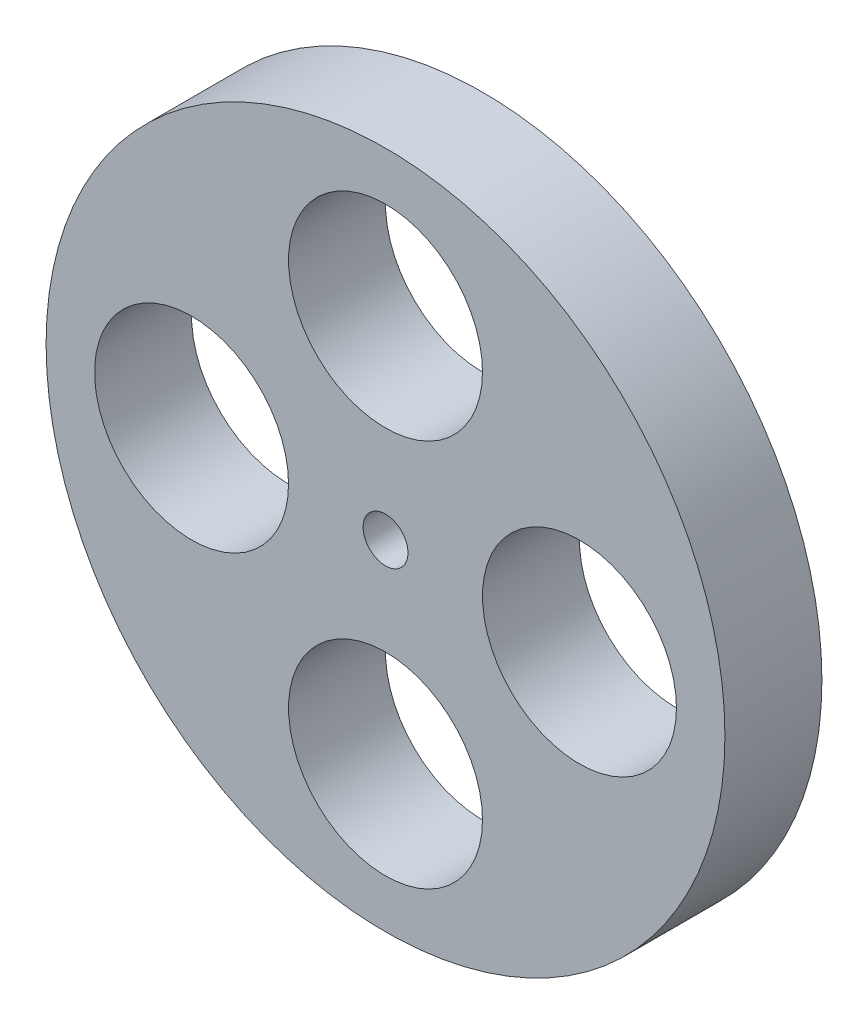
ISO-10303-21;
HEADER;
FILE_DESCRIPTION(('STEP AP214'),'2;1');
FILE_NAME('part.step','',(''),(''),'','','');
FILE_SCHEMA(('AUTOMOTIVE_DESIGN { 1 0 10303 214 1 1 1 1 }'));
ENDSEC;
DATA;
#1=APPLICATION_CONTEXT('core data for automotive mechanical design processes');
#2=APPLICATION_PROTOCOL_DEFINITION('international standard','automotive_design',2000,#1);
#3=PRODUCT_CONTEXT('',#1,'mechanical');
#4=PRODUCT('Part','Part','',(#3));
#5=PRODUCT_RELATED_PRODUCT_CATEGORY('part','',(#4));
#6=PRODUCT_DEFINITION_FORMATION('','',#4);
#7=PRODUCT_DEFINITION_CONTEXT('part definition',#1,'design');
#8=PRODUCT_DEFINITION('design','',#6,#7);
#9=PRODUCT_DEFINITION_SHAPE('','',#8);
#10=(LENGTH_UNIT() NAMED_UNIT(*) SI_UNIT(.MILLI.,.METRE.));
#11=(NAMED_UNIT(*) PLANE_ANGLE_UNIT() SI_UNIT($,.RADIAN.));
#12=(NAMED_UNIT(*) SI_UNIT($,.STERADIAN.) SOLID_ANGLE_UNIT());
#13=UNCERTAINTY_MEASURE_WITH_UNIT(LENGTH_MEASURE(1.E-05),#10,'distance_accuracy_value','');
#14=(GEOMETRIC_REPRESENTATION_CONTEXT(3) GLOBAL_UNCERTAINTY_ASSIGNED_CONTEXT((#13)) GLOBAL_UNIT_ASSIGNED_CONTEXT((#10,
#11,#12)) REPRESENTATION_CONTEXT('',''));
#15=CARTESIAN_POINT('',(0.,0.,0.));
#16=DIRECTION('',(0.,0.,1.));
#17=DIRECTION('',(1.,0.,0.));
#18=AXIS2_PLACEMENT_3D('',#15,#16,#17);
#19=CARTESIAN_POINT('',(0.,0.,12.7));
#20=DIRECTION('',(0.,0.,1.));
#21=DIRECTION('',(1.,0.,0.));
#22=AXIS2_PLACEMENT_3D('',#19,#20,#21);
#23=PLANE('',#22);
#24=CARTESIAN_POINT('',(-1.77367252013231E-13,-25.4,12.7));
#25=DIRECTION('',(0.,0.,1.));
#26=DIRECTION('',(1.,0.,0.));
#27=AXIS2_PLACEMENT_3D('',#24,#25,#26);
#28=CIRCLE('',#27,12.7);
#29=CARTESIAN_POINT('',(12.6999999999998,-25.4,12.7));
#30=VERTEX_POINT('',#29);
#31=EDGE_CURVE('E78',#30,#30,#28,.T.);
#32=ORIENTED_EDGE('',*,*,#31,.F.);
#33=EDGE_LOOP('',(#32));
#34=FACE_BOUND('',#33,.T.);
#35=CARTESIAN_POINT('',(0.,25.4,12.7));
#36=DIRECTION('',(0.,0.,1.));
#37=DIRECTION('',(1.,0.,0.));
#38=AXIS2_PLACEMENT_3D('',#35,#36,#37);
#39=CIRCLE('',#38,12.7);
#40=CARTESIAN_POINT('',(12.7,25.4,12.7));
#41=VERTEX_POINT('',#40);
#42=EDGE_CURVE('E62',#41,#41,#39,.T.);
#43=ORIENTED_EDGE('',*,*,#42,.F.);
#44=EDGE_LOOP('',(#43));
#45=FACE_BOUND('',#44,.T.);
#46=CARTESIAN_POINT('',(0.,0.,12.7));
#47=DIRECTION('',(0.,0.,1.));
#48=DIRECTION('',(1.,0.,0.));
#49=AXIS2_PLACEMENT_3D('',#46,#47,#48);
#50=CIRCLE('',#49,44.45);
#51=CARTESIAN_POINT('',(44.45,0.,12.7));
#52=VERTEX_POINT('',#51);
#53=EDGE_CURVE('E10',#52,#52,#50,.T.);
#54=ORIENTED_EDGE('',*,*,#53,.T.);
#55=EDGE_LOOP('',(#54));
#56=FACE_BOUND('',#55,.T.);
#57=CARTESIAN_POINT('',(0.,0.,12.7));
#58=DIRECTION('',(0.,0.,1.));
#59=DIRECTION('',(1.,0.,0.));
#60=AXIS2_PLACEMENT_3D('',#57,#58,#59);
#61=CIRCLE('',#60,2.936499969);
#62=CARTESIAN_POINT('',(2.936499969,0.,12.7));
#63=VERTEX_POINT('',#62);
#64=EDGE_CURVE('E56',#63,#63,#61,.T.);
#65=ORIENTED_EDGE('',*,*,#64,.F.);
#66=EDGE_LOOP('',(#65));
#67=FACE_BOUND('',#66,.T.);
#68=CARTESIAN_POINT('',(25.4,0.,12.7));
#69=DIRECTION('',(0.,0.,1.));
#70=DIRECTION('',(1.,0.,0.));
#71=AXIS2_PLACEMENT_3D('',#68,#69,#70);
#72=CIRCLE('',#71,12.7);
#73=CARTESIAN_POINT('',(38.1,0.,12.7));
#74=VERTEX_POINT('',#73);
#75=EDGE_CURVE('E70',#74,#74,#72,.T.);
#76=ORIENTED_EDGE('',*,*,#75,.F.);
#77=EDGE_LOOP('',(#76));
#78=FACE_BOUND('',#77,.T.);
#79=CARTESIAN_POINT('',(-25.4,2.66050878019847E-13,12.7));
#80=DIRECTION('',(0.,0.,1.));
#81=DIRECTION('',(1.,0.,0.));
#82=AXIS2_PLACEMENT_3D('',#79,#80,#81);
#83=CIRCLE('',#82,12.7);
#84=CARTESIAN_POINT('',(-12.7,2.66050878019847E-13,12.7));
#85=VERTEX_POINT('',#84);
#86=EDGE_CURVE('E86',#85,#85,#83,.T.);
#87=ORIENTED_EDGE('',*,*,#86,.F.);
#88=EDGE_LOOP('',(#87));
#89=FACE_BOUND('',#88,.T.);
#90=ADVANCED_FACE('F43',(#34,#45,#56,#67,#78,#89),#23,.T.);
#91=CARTESIAN_POINT('',(0.,0.,0.));
#92=DIRECTION('',(0.,0.,1.));
#93=DIRECTION('',(1.,0.,0.));
#94=AXIS2_PLACEMENT_3D('',#91,#92,#93);
#95=PLANE('',#94);
#96=CARTESIAN_POINT('',(0.,0.,0.));
#97=DIRECTION('',(0.,0.,1.));
#98=DIRECTION('',(1.,0.,0.));
#99=AXIS2_PLACEMENT_3D('',#96,#97,#98);
#100=CIRCLE('',#99,44.45);
#101=CARTESIAN_POINT('',(44.45,0.,0.));
#102=VERTEX_POINT('',#101);
#103=EDGE_CURVE('E47',#102,#102,#100,.T.);
#104=ORIENTED_EDGE('',*,*,#103,.F.);
#105=EDGE_LOOP('',(#104));
#106=FACE_BOUND('',#105,.T.);
#107=CARTESIAN_POINT('',(0.,0.,0.));
#108=DIRECTION('',(0.,0.,1.));
#109=DIRECTION('',(1.,0.,0.));
#110=AXIS2_PLACEMENT_3D('',#107,#108,#109);
#111=CIRCLE('',#110,2.936499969);
#112=CARTESIAN_POINT('',(2.936499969,0.,0.));
#113=VERTEX_POINT('',#112);
#114=EDGE_CURVE('E58',#113,#113,#111,.T.);
#115=ORIENTED_EDGE('',*,*,#114,.T.);
#116=EDGE_LOOP('',(#115));
#117=FACE_BOUND('',#116,.T.);
#118=CARTESIAN_POINT('',(0.,25.4,0.));
#119=DIRECTION('',(0.,0.,1.));
#120=DIRECTION('',(1.,0.,0.));
#121=AXIS2_PLACEMENT_3D('',#118,#119,#120);
#122=CIRCLE('',#121,12.7);
#123=CARTESIAN_POINT('',(12.7,25.4,0.));
#124=VERTEX_POINT('',#123);
#125=EDGE_CURVE('E66',#124,#124,#122,.T.);
#126=ORIENTED_EDGE('',*,*,#125,.T.);
#127=EDGE_LOOP('',(#126));
#128=FACE_BOUND('',#127,.T.);
#129=CARTESIAN_POINT('',(25.4,0.,0.));
#130=DIRECTION('',(0.,0.,1.));
#131=DIRECTION('',(1.,0.,0.));
#132=AXIS2_PLACEMENT_3D('',#129,#130,#131);
#133=CIRCLE('',#132,12.7);
#134=CARTESIAN_POINT('',(38.1,0.,0.));
#135=VERTEX_POINT('',#134);
#136=EDGE_CURVE('E74',#135,#135,#133,.T.);
#137=ORIENTED_EDGE('',*,*,#136,.T.);
#138=EDGE_LOOP('',(#137));
#139=FACE_BOUND('',#138,.T.);
#140=CARTESIAN_POINT('',(-1.77367252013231E-13,-25.4,0.));
#141=DIRECTION('',(0.,0.,1.));
#142=DIRECTION('',(1.,0.,0.));
#143=AXIS2_PLACEMENT_3D('',#140,#141,#142);
#144=CIRCLE('',#143,12.7);
#145=CARTESIAN_POINT('',(12.6999999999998,-25.4,0.));
#146=VERTEX_POINT('',#145);
#147=EDGE_CURVE('E82',#146,#146,#144,.T.);
#148=ORIENTED_EDGE('',*,*,#147,.T.);
#149=EDGE_LOOP('',(#148));
#150=FACE_BOUND('',#149,.T.);
#151=CARTESIAN_POINT('',(-25.4,2.66050878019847E-13,0.));
#152=DIRECTION('',(0.,0.,1.));
#153=DIRECTION('',(1.,0.,0.));
#154=AXIS2_PLACEMENT_3D('',#151,#152,#153);
#155=CIRCLE('',#154,12.7);
#156=CARTESIAN_POINT('',(-12.7,2.66050878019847E-13,0.));
#157=VERTEX_POINT('',#156);
#158=EDGE_CURVE('E90',#157,#157,#155,.T.);
#159=ORIENTED_EDGE('',*,*,#158,.T.);
#160=EDGE_LOOP('',(#159));
#161=FACE_BOUND('',#160,.T.);
#162=ADVANCED_FACE('F102',(#106,#117,#128,#139,#150,#161),#95,.F.);
#163=CARTESIAN_POINT('',(0.,0.,12.7));
#164=DIRECTION('',(0.,0.,-1.));
#165=DIRECTION('',(-1.,0.,0.));
#166=AXIS2_PLACEMENT_3D('',#163,#164,#165);
#167=CYLINDRICAL_SURFACE('',#166,44.45);
#168=ORIENTED_EDGE('',*,*,#53,.F.);
#169=EDGE_LOOP('',(#168));
#170=FACE_BOUND('',#169,.T.);
#171=ORIENTED_EDGE('',*,*,#103,.T.);
#172=EDGE_LOOP('',(#171));
#173=FACE_BOUND('',#172,.T.);
#174=ADVANCED_FACE('F45',(#170,#173),#167,.T.);
#175=CARTESIAN_POINT('',(0.,0.,12.7));
#176=DIRECTION('',(0.,0.,-1.));
#177=DIRECTION('',(-1.,0.,0.));
#178=AXIS2_PLACEMENT_3D('',#175,#176,#177);
#179=CYLINDRICAL_SURFACE('',#178,2.936499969);
#180=ORIENTED_EDGE('',*,*,#64,.T.);
#181=EDGE_LOOP('',(#180));
#182=FACE_BOUND('',#181,.T.);
#183=ORIENTED_EDGE('',*,*,#114,.F.);
#184=EDGE_LOOP('',(#183));
#185=FACE_BOUND('',#184,.T.);
#186=ADVANCED_FACE('F112',(#182,#185),#179,.F.);
#187=CARTESIAN_POINT('',(0.,25.4,12.7));
#188=DIRECTION('',(0.,0.,-1.));
#189=DIRECTION('',(-1.,0.,0.));
#190=AXIS2_PLACEMENT_3D('',#187,#188,#189);
#191=CYLINDRICAL_SURFACE('',#190,12.7);
#192=ORIENTED_EDGE('',*,*,#42,.T.);
#193=EDGE_LOOP('',(#192));
#194=FACE_BOUND('',#193,.T.);
#195=ORIENTED_EDGE('',*,*,#125,.F.);
#196=EDGE_LOOP('',(#195));
#197=FACE_BOUND('',#196,.T.);
#198=ADVANCED_FACE('F115',(#194,#197),#191,.F.);
#199=CARTESIAN_POINT('',(25.4,0.,12.7));
#200=DIRECTION('',(0.,0.,-1.));
#201=DIRECTION('',(-1.,0.,0.));
#202=AXIS2_PLACEMENT_3D('',#199,#200,#201);
#203=CYLINDRICAL_SURFACE('',#202,12.7);
#204=ORIENTED_EDGE('',*,*,#75,.T.);
#205=EDGE_LOOP('',(#204));
#206=FACE_BOUND('',#205,.T.);
#207=ORIENTED_EDGE('',*,*,#136,.F.);
#208=EDGE_LOOP('',(#207));
#209=FACE_BOUND('',#208,.T.);
#210=ADVANCED_FACE('F119',(#206,#209),#203,.F.);
#211=CARTESIAN_POINT('',(-1.77367252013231E-13,-25.4,12.7));
#212=DIRECTION('',(0.,0.,-1.));
#213=DIRECTION('',(-1.,0.,0.));
#214=AXIS2_PLACEMENT_3D('',#211,#212,#213);
#215=CYLINDRICAL_SURFACE('',#214,12.7);
#216=ORIENTED_EDGE('',*,*,#31,.T.);
#217=EDGE_LOOP('',(#216));
#218=FACE_BOUND('',#217,.T.);
#219=ORIENTED_EDGE('',*,*,#147,.F.);
#220=EDGE_LOOP('',(#219));
#221=FACE_BOUND('',#220,.T.);
#222=ADVANCED_FACE('F123',(#218,#221),#215,.F.);
#223=CARTESIAN_POINT('',(-25.4,2.66050878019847E-13,12.7));
#224=DIRECTION('',(0.,0.,-1.));
#225=DIRECTION('',(-1.,0.,0.));
#226=AXIS2_PLACEMENT_3D('',#223,#224,#225);
#227=CYLINDRICAL_SURFACE('',#226,12.7);
#228=ORIENTED_EDGE('',*,*,#86,.T.);
#229=EDGE_LOOP('',(#228));
#230=FACE_BOUND('',#229,.T.);
#231=ORIENTED_EDGE('',*,*,#158,.F.);
#232=EDGE_LOOP('',(#231));
#233=FACE_BOUND('',#232,.T.);
#234=ADVANCED_FACE('F98',(#230,#233),#227,.F.);
#235=CLOSED_SHELL('',(#90,#162,#174,#186,#198,#210,#222,#234));
#236=MANIFOLD_SOLID_BREP('B2',#235);
#237=ADVANCED_BREP_SHAPE_REPRESENTATION('',(#18,#236),#14);
#238=SHAPE_DEFINITION_REPRESENTATION(#9,#237);
ENDSEC;
END-ISO-10303-21;
